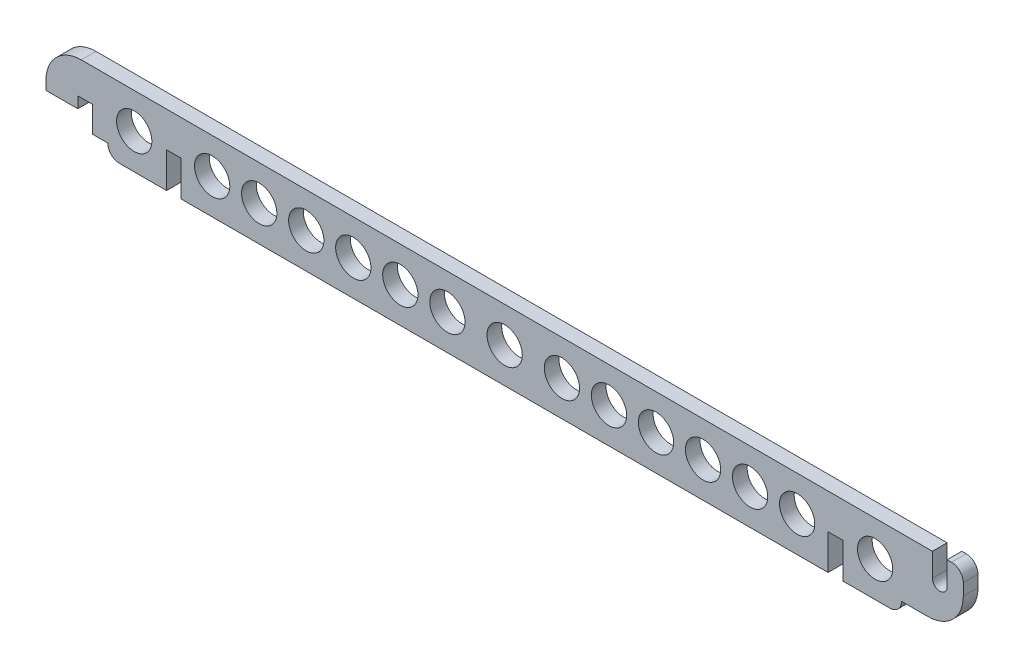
from build123d import *

# Parameters (mm, degrees)
SKETCH1_R           = 3.81
BOSS_EXTRUDE1_DEPTH = 3.175


with BuildPart() as part:
    # Sketch1 → Boss-Extrude1 (new body)
    with BuildSketch(Plane.XY):
        with BuildLine():
            Line((13.474140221, 28.81862821), (13.474140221, 31.35862821))
            ThreePointArc((13.474140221, 31.35862821), (12.730191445, 33.154679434), (10.934140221, 33.89862821))
            Line((10.934140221, 33.89862821), (9.981640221, 33.89862821))
            Line((9.981640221, 33.89862821), (9.981640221, 28.81862821))
            ThreePointArc((9.981640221, 28.81862821), (8.394140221, 27.23112821), (6.806640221, 28.81862821))
            Line((6.806640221, 28.81862821), (6.806640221, 33.89862821))
            Line((6.806640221, 33.89862821), (-177.025859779, 33.89862821))
            ThreePointArc((-177.025859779, 33.89862821), (-182.414013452, 31.666781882), (-184.645859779, 26.27862821))
            Line((-184.645859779, 26.27862821), (-184.645859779, 24.37362821))
            Line((-184.645859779, 24.37362821), (-177.787859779, 24.37362821))
            Line((-177.787859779, 24.37362821), (-177.787859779, 26.799063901))
            Line((-177.787859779, 26.799063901), (-174.612859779, 26.799063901))
            Line((-174.612859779, 26.799063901), (-174.612859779, 21.19862821))
            Line((-174.612859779, 21.19862821), (-171.310859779, 21.19862821))
            ThreePointArc((-171.310859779, 21.19862821), (-170.566911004, 19.402576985), (-168.770859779, 18.65862821))
            Line((-168.770859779, 18.65862821), (-158.610859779, 18.65862821))
            Line((-158.610859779, 18.65862821), (-158.610859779, 26.27862821))
            Line((-158.610859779, 26.27862821), (-155.435859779, 26.27862821))
            Line((-155.435859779, 26.27862821), (-155.435859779, 18.65862821))
            Line((-155.435859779, 18.65862821), (-15.735859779, 18.65862821))
            Line((-15.735859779, 18.65862821), (-15.735859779, 26.27862821))
            Line((-15.735859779, 26.27862821), (-12.560859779, 26.27862821))
            Line((-12.560859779, 26.27862821), (-12.560859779, 18.65862821))
            Line((-12.560859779, 18.65862821), (-2.400859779, 18.65862821))
            ThreePointArc((-2.400859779, 18.65862821), (-0.604808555, 19.402576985), (0.139140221, 21.19862821))
            Line((0.139140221, 21.19862821), (5.854140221, 21.19862821))
            ThreePointArc((5.854140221, 21.19862821), (11.242293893, 23.430474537), (13.474140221, 28.81862821))
        make_face()
        with Locations((-165.595698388, 26.27862821)):
            Circle(SKETCH1_R, mode=Mode.SUBTRACT)
        with Locations((-148.757147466, 26.27862821)):
            Circle(SKETCH1_R, mode=Mode.SUBTRACT)
        with Locations((-138.597147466, 26.27862821)):
            Circle(SKETCH1_R, mode=Mode.SUBTRACT)
        with Locations((-128.437147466, 26.27862821)):
            Circle(SKETCH1_R, mode=Mode.SUBTRACT)
        with Locations((-118.277147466, 26.27862821)):
            Circle(SKETCH1_R, mode=Mode.SUBTRACT)
        with Locations((-108.117147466, 26.27862821)):
            Circle(SKETCH1_R, mode=Mode.SUBTRACT)
        with Locations((-97.957147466, 26.27862821)):
            Circle(SKETCH1_R, mode=Mode.SUBTRACT)
        with Locations(Location((-73.214572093, 26.27862821, 0), (0, 0, 180))):
            Circle(SKETCH1_R, mode=Mode.SUBTRACT)
        with Locations(Location((-63.054572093, 26.27862821, 0), (0, 0, 180))):
            Circle(SKETCH1_R, mode=Mode.SUBTRACT)
        with Locations(Location((-52.894572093, 26.27862821, 0), (0, 0, 180))):
            Circle(SKETCH1_R, mode=Mode.SUBTRACT)
        with Locations(Location((-42.734572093, 26.27862821, 0), (0, 0, 180))):
            Circle(SKETCH1_R, mode=Mode.SUBTRACT)
        with Locations(Location((-32.574572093, 26.27862821, 0), (0, 0, 180))):
            Circle(SKETCH1_R, mode=Mode.SUBTRACT)
        with Locations(Location((-22.414572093, 26.27862821, 0), (0, 0, 180))):
            Circle(SKETCH1_R, mode=Mode.SUBTRACT)
        with Locations(Location((-5.576021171, 26.27862821, 0), (0, 0, 180))):
            Circle(SKETCH1_R, mode=Mode.SUBTRACT)
        with Locations((-85.585859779, 26.27862821)):
            Circle(SKETCH1_R, mode=Mode.SUBTRACT)
    extrude(amount=BOSS_EXTRUDE1_DEPTH)


solid = part.part
